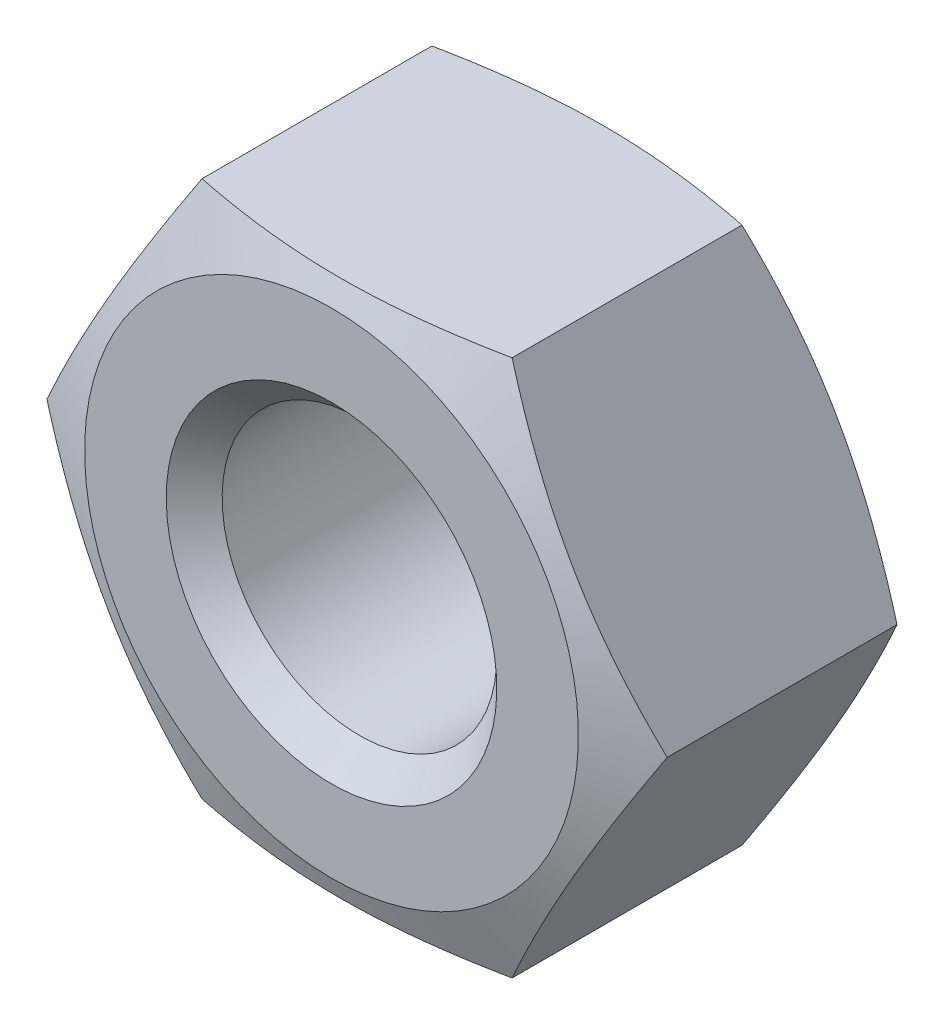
ISO-10303-21;
HEADER;
FILE_DESCRIPTION(('STEP AP214'),'2;1');
FILE_NAME('part.step','',(''),(''),'','','');
FILE_SCHEMA(('AUTOMOTIVE_DESIGN { 1 0 10303 214 1 1 1 1 }'));
ENDSEC;
DATA;
#1=APPLICATION_CONTEXT('core data for automotive mechanical design processes');
#2=APPLICATION_PROTOCOL_DEFINITION('international standard','automotive_design',2000,#1);
#3=PRODUCT_CONTEXT('',#1,'mechanical');
#4=PRODUCT('Part','Part','',(#3));
#5=PRODUCT_RELATED_PRODUCT_CATEGORY('part','',(#4));
#6=PRODUCT_DEFINITION_FORMATION('','',#4);
#7=PRODUCT_DEFINITION_CONTEXT('part definition',#1,'design');
#8=PRODUCT_DEFINITION('design','',#6,#7);
#9=PRODUCT_DEFINITION_SHAPE('','',#8);
#10=(LENGTH_UNIT() NAMED_UNIT(*) SI_UNIT(.MILLI.,.METRE.));
#11=(NAMED_UNIT(*) PLANE_ANGLE_UNIT() SI_UNIT($,.RADIAN.));
#12=(NAMED_UNIT(*) SI_UNIT($,.STERADIAN.) SOLID_ANGLE_UNIT());
#13=UNCERTAINTY_MEASURE_WITH_UNIT(LENGTH_MEASURE(1.E-05),#10,'distance_accuracy_value','');
#14=(GEOMETRIC_REPRESENTATION_CONTEXT(3) GLOBAL_UNCERTAINTY_ASSIGNED_CONTEXT((#13)) GLOBAL_UNIT_ASSIGNED_CONTEXT((#10,
#11,#12)) REPRESENTATION_CONTEXT('',''));
#15=CARTESIAN_POINT('',(0.,0.,0.));
#16=DIRECTION('',(0.,0.,1.));
#17=DIRECTION('',(1.,0.,0.));
#18=AXIS2_PLACEMENT_3D('',#15,#16,#17);
#19=CARTESIAN_POINT('',(7.50555,0.,6.8));
#20=DIRECTION('',(0.,0.,1.));
#21=DIRECTION('',(1.,0.,0.));
#22=AXIS2_PLACEMENT_3D('',#19,#20,#21);
#23=PLANE('',#22);
#24=CARTESIAN_POINT('',(0.,0.,6.8));
#25=DIRECTION('',(0.,0.,-1.));
#26=DIRECTION('',(0.,1.,0.));
#27=AXIS2_PLACEMENT_3D('',#24,#25,#26);
#28=CIRCLE('',#27,4.);
#29=CARTESIAN_POINT('',(0.,4.,6.8));
#30=VERTEX_POINT('',#29);
#31=EDGE_CURVE('E205',#30,#30,#28,.T.);
#32=ORIENTED_EDGE('',*,*,#31,.T.);
#33=EDGE_LOOP('',(#32));
#34=FACE_BOUND('',#33,.T.);
#35=CARTESIAN_POINT('',(0.,0.,6.8));
#36=DIRECTION('',(0.,0.,-1.));
#37=DIRECTION('',(0.,1.,0.));
#38=AXIS2_PLACEMENT_3D('',#35,#36,#37);
#39=CIRCLE('',#38,5.9754963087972);
#40=CARTESIAN_POINT('',(0.,5.9754963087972,6.8));
#41=VERTEX_POINT('',#40);
#42=EDGE_CURVE('E208',#41,#41,#39,.T.);
#43=ORIENTED_EDGE('',*,*,#42,.F.);
#44=EDGE_LOOP('',(#43));
#45=FACE_BOUND('',#44,.T.);
#46=ADVANCED_FACE('F14',(#34,#45),#23,.T.);
#47=CARTESIAN_POINT('',(0.,0.,6.8));
#48=DIRECTION('',(0.,0.,1.));
#49=DIRECTION('',(0.,-1.,0.));
#50=AXIS2_PLACEMENT_3D('',#47,#48,#49);
#51=CONICAL_SURFACE('',#50,4.,0.785398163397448);
#52=CARTESIAN_POINT('',(0.,0.,6.1234375));
#53=DIRECTION('',(0.,0.,-1.));
#54=DIRECTION('',(0.,1.,0.));
#55=AXIS2_PLACEMENT_3D('',#52,#53,#54);
#56=CIRCLE('',#55,3.3234375);
#57=CARTESIAN_POINT('',(0.,3.3234375,6.1234375));
#58=VERTEX_POINT('',#57);
#59=EDGE_CURVE('E95',#58,#58,#56,.T.);
#60=ORIENTED_EDGE('',*,*,#59,.T.);
#61=EDGE_LOOP('',(#60));
#62=FACE_BOUND('',#61,.T.);
#63=ORIENTED_EDGE('',*,*,#31,.F.);
#64=EDGE_LOOP('',(#63));
#65=FACE_BOUND('',#64,.T.);
#66=ADVANCED_FACE('F138',(#62,#65),#51,.F.);
#67=CARTESIAN_POINT('',(0.,0.,0.));
#68=DIRECTION('',(0.,0.,-1.));
#69=DIRECTION('',(0.,1.,0.));
#70=AXIS2_PLACEMENT_3D('',#67,#68,#69);
#71=CYLINDRICAL_SURFACE('',#70,3.3234375);
#72=CARTESIAN_POINT('',(0.,0.,0.6765625));
#73=DIRECTION('',(0.,0.,-1.));
#74=DIRECTION('',(0.,1.,0.));
#75=AXIS2_PLACEMENT_3D('',#72,#73,#74);
#76=CIRCLE('',#75,3.3234375);
#77=CARTESIAN_POINT('',(0.,3.3234375,0.6765625));
#78=VERTEX_POINT('',#77);
#79=EDGE_CURVE('E92',#78,#78,#76,.T.);
#80=ORIENTED_EDGE('',*,*,#79,.T.);
#81=EDGE_LOOP('',(#80));
#82=FACE_BOUND('',#81,.T.);
#83=ORIENTED_EDGE('',*,*,#59,.F.);
#84=EDGE_LOOP('',(#83));
#85=FACE_BOUND('',#84,.T.);
#86=ADVANCED_FACE('F200',(#82,#85),#71,.F.);
#87=CARTESIAN_POINT('',(0.,0.,0.));
#88=DIRECTION('',(0.,0.,-1.));
#89=DIRECTION('',(0.,1.,0.));
#90=AXIS2_PLACEMENT_3D('',#87,#88,#89);
#91=CONICAL_SURFACE('',#90,4.,0.785398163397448);
#92=ORIENTED_EDGE('',*,*,#79,.F.);
#93=EDGE_LOOP('',(#92));
#94=FACE_BOUND('',#93,.T.);
#95=CARTESIAN_POINT('',(0.,0.,0.));
#96=DIRECTION('',(0.,0.,-1.));
#97=DIRECTION('',(0.,1.,0.));
#98=AXIS2_PLACEMENT_3D('',#95,#96,#97);
#99=CIRCLE('',#98,4.);
#100=CARTESIAN_POINT('',(0.,4.,0.));
#101=VERTEX_POINT('',#100);
#102=EDGE_CURVE('E209',#101,#101,#99,.T.);
#103=ORIENTED_EDGE('',*,*,#102,.T.);
#104=EDGE_LOOP('',(#103));
#105=FACE_BOUND('',#104,.T.);
#106=ADVANCED_FACE('F136',(#94,#105),#91,.F.);
#107=CARTESIAN_POINT('',(0.,0.,6.18181818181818));
#108=DIRECTION('',(0.,0.,-1.));
#109=DIRECTION('',(0.,1.,0.));
#110=AXIS2_PLACEMENT_3D('',#107,#108,#109);
#111=CONICAL_SURFACE('',#110,7.50555,1.18682389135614);
#112=ORIENTED_EDGE('',*,*,#42,.T.);
#113=EDGE_LOOP('',(#112));
#114=FACE_BOUND('',#113,.T.);
#115=CARTESIAN_POINT('',(-9.9193088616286,-6.49999696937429,4.42279492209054));
#116=CARTESIAN_POINT('',(-9.62612976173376,-6.49999696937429,4.5218419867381));
#117=CARTESIAN_POINT('',(-9.3325605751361,-6.49999696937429,4.61975569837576));
#118=CARTESIAN_POINT('',(-8.74444019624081,-6.49999696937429,4.81268318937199));
#119=CARTESIAN_POINT('',(-8.44988891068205,-6.49999696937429,4.90769668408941));
#120=CARTESIAN_POINT('',(-7.8589466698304,-6.49999696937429,5.09439618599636));
#121=CARTESIAN_POINT('',(-7.56255298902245,-6.49999696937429,5.18607359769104));
#122=CARTESIAN_POINT('',(-6.96842688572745,-6.49999696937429,5.36497357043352));
#123=CARTESIAN_POINT('',(-6.67069449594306,-6.49999696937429,5.45219623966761));
#124=CARTESIAN_POINT('',(-6.07749078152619,-6.49999696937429,5.61997733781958));
#125=CARTESIAN_POINT('',(-5.78203974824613,-6.49999696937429,5.70060715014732));
#126=CARTESIAN_POINT('',(-5.18934038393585,-6.49999696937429,5.85505393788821));
#127=CARTESIAN_POINT('',(-4.8920920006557,-6.49999696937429,5.92887071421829));
#128=CARTESIAN_POINT('',(-4.29575537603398,-6.49999696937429,6.06792713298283));
#129=CARTESIAN_POINT('',(-3.9966682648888,-6.49999696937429,6.13317158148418));
#130=CARTESIAN_POINT('',(-3.39636834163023,-6.49999696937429,6.25306571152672));
#131=CARTESIAN_POINT('',(-3.09515568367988,-6.49999696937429,6.30771615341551));
#132=CARTESIAN_POINT('',(-2.55247765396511,-6.49999696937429,6.3942718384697));
#133=CARTESIAN_POINT('',(-2.31139156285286,-6.49999696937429,6.42854298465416));
#134=CARTESIAN_POINT('',(-1.82807101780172,-6.49999696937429,6.4877891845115));
#135=CARTESIAN_POINT('',(-1.58583659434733,-6.49999696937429,6.51276448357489));
#136=CARTESIAN_POINT('',(-1.1006741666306,-6.49999696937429,6.55243028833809));
#137=CARTESIAN_POINT('',(-0.857746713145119,-6.49999696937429,6.56712744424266));
#138=CARTESIAN_POINT('',(-0.371473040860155,-6.49999696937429,6.5856209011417));
#139=CARTESIAN_POINT('',(-0.128126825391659,-6.49999696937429,6.58941728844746));
#140=CARTESIAN_POINT('',(0.359662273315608,-6.49999696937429,6.58592570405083));
#141=CARTESIAN_POINT('',(0.604104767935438,-6.49999696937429,6.57858403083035));
#142=CARTESIAN_POINT('',(1.09241838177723,-6.49999696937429,6.55305516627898));
#143=CARTESIAN_POINT('',(1.33628949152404,-6.49999696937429,6.53486779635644));
#144=CARTESIAN_POINT('',(1.82321426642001,-6.49999696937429,6.48841131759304));
#145=CARTESIAN_POINT('',(2.06626731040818,-6.49999696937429,6.46013578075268));
#146=CARTESIAN_POINT('',(2.55113865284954,-6.49999696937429,6.3945695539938));
#147=CARTESIAN_POINT('',(2.79295695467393,-6.4999969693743,6.35727888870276));
#148=CARTESIAN_POINT('',(3.31552776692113,-6.4999969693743,6.26797739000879));
#149=CARTESIAN_POINT('',(3.59603630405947,-6.4999969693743,6.21454818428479));
#150=CARTESIAN_POINT('',(4.15523748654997,-6.49999696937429,6.09884430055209));
#151=CARTESIAN_POINT('',(4.4339299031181,-6.49999696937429,6.03656852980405));
#152=CARTESIAN_POINT('',(4.98973006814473,-6.4999969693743,5.90477408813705));
#153=CARTESIAN_POINT('',(5.26683696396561,-6.49999696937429,5.8352518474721));
#154=CARTESIAN_POINT('',(5.81949820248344,-6.49999696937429,5.69036285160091));
#155=CARTESIAN_POINT('',(6.09505260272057,-6.4999969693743,5.61499631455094));
#156=CARTESIAN_POINT('',(6.64553916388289,-6.4999969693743,5.45932492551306));
#157=CARTESIAN_POINT('',(6.92046778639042,-6.4999969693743,5.37900761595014));
#158=CARTESIAN_POINT('',(7.46916437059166,-6.4999969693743,5.21450845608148));
#159=CARTESIAN_POINT('',(7.74293232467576,-6.4999969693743,5.13032658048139));
#160=CARTESIAN_POINT('',(8.28940004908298,-6.4999969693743,4.95883283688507));
#161=CARTESIAN_POINT('',(8.56210009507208,-6.4999969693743,4.87152184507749));
#162=CARTESIAN_POINT('',(9.10665643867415,-6.4999969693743,4.69430366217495));
#163=CARTESIAN_POINT('',(9.37851272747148,-6.4999969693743,4.60439644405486));
#164=CARTESIAN_POINT('',(10.1893622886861,-6.4999969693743,4.33269358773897));
#165=CARTESIAN_POINT('',(10.7273011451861,-6.4999969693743,4.1477522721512));
#166=CARTESIAN_POINT('',(11.8011433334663,-6.4999969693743,3.77195807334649));
#167=CARTESIAN_POINT('',(12.337046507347,-6.4999969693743,3.5811047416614));
#168=CARTESIAN_POINT('',(13.4037617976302,-6.4999969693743,3.19638995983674));
#169=CARTESIAN_POINT('',(13.934584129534,-6.4999969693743,3.00255679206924));
#170=CARTESIAN_POINT('',(14.7299098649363,-6.4999969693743,2.70945395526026));
#171=CARTESIAN_POINT('',(14.9948504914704,-6.4999969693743,2.6113670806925));
#172=CARTESIAN_POINT('',(15.5244732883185,-6.4999969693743,2.41450084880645));
#173=CARTESIAN_POINT('',(15.7891554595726,-6.4999969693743,2.31572149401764));
#174=CARTESIAN_POINT('',(16.053725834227,-6.4999969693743,2.21664343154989));
#175=B_SPLINE_CURVE_WITH_KNOTS('',3,(#115,#116,#117,#118,#119,#120,#121,#122,#123,#124,#125,
#126,#127,#128,#129,#130,#131,#132,#133,#134,#135,#136,#137,#138,#139,#140,#141,#142,#143,#144,
#145,#146,#147,#148,#149,#150,#151,#152,#153,#154,#155,#156,#157,#158,#159,#160,#161,#162,#163,
#164,#165,#166,#167,#168,#169,#170,#171,#172,#173,#174),.UNSPECIFIED.,.F.,.F.,(4,2,2,2,2,2,2,2,
2,2,2,2,2,2,2,2,2,2,2,2,2,2,2,2,2,2,2,2,2,4),(0.,0.928382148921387,1.85685512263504,
2.78757170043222,3.71826566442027,4.63696855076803,5.55569827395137,6.47391069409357,
7.39205718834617,8.12243097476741,8.85278547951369,9.58266698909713,10.3125427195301,
11.0459487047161,11.7793667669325,12.5132529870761,13.247137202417,14.1036136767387,
14.9601960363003,15.8172023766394,16.6741767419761,17.5334032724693,18.3926354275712,
19.2516288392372,20.1106311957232,21.8171010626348,23.523700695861,25.2190012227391,
26.0665447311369,26.9140851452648),.UNSPECIFIED.);
#176=CARTESIAN_POINT('',(-3.752775,-6.49999696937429,6.18181818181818));
#177=VERTEX_POINT('',#176);
#178=CARTESIAN_POINT('',(3.752775,-6.4999969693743,6.18181818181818));
#179=VERTEX_POINT('',#178);
#180=EDGE_CURVE('E75',#177,#179,#175,.T.);
#181=ORIENTED_EDGE('',*,*,#180,.T.);
#182=CARTESIAN_POINT('',(3.75277488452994,-6.4999971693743,6.18181813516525));
#183=CARTESIAN_POINT('',(3.88388671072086,-6.27290482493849,6.23479379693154));
#184=CARTESIAN_POINT('',(4.0154312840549,-6.04506294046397,6.28377831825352));
#185=CARTESIAN_POINT('',(4.27939025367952,-5.5878725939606,6.37225953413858));
#186=CARTESIAN_POINT('',(4.41180511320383,-5.3585233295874,6.41175066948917));
#187=CARTESIAN_POINT('',(4.67731617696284,-4.89864467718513,6.47966399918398));
#188=CARTESIAN_POINT('',(4.81041216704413,-4.66811566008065,6.50808947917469));
#189=CARTESIAN_POINT('',(5.07709854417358,-4.20620130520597,6.55255421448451));
#190=CARTESIAN_POINT('',(5.21068881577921,-3.9748161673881,6.56859619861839));
#191=CARTESIAN_POINT('',(5.47583563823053,-3.51556839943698,6.58729635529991));
#192=CARTESIAN_POINT('',(5.60738820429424,-3.28771267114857,6.59017716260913));
#193=CARTESIAN_POINT('',(5.87041559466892,-2.83213586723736,6.58300544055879));
#194=CARTESIAN_POINT('',(6.00189041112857,-2.60441480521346,6.57295177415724));
#195=CARTESIAN_POINT('',(6.26436520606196,-2.1497951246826,6.54045156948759));
#196=CARTESIAN_POINT('',(6.39536543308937,-1.92289607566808,6.51801290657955));
#197=CARTESIAN_POINT('',(6.65674042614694,-1.4701813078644,6.46183013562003));
#198=CARTESIAN_POINT('',(6.78711525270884,-1.24436548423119,6.42808714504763));
#199=CARTESIAN_POINT('',(6.96628658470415,-0.934031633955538,6.37474923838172));
#200=CARTESIAN_POINT('',(7.01540954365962,-0.848948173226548,6.35940032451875));
#201=CARTESIAN_POINT('',(7.11353952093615,-0.67898206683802,6.32736591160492));
#202=CARTESIAN_POINT('',(7.16254655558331,-0.594099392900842,6.31068061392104));
#203=CARTESIAN_POINT('',(7.26061650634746,-0.424237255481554,6.27599122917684));
#204=CARTESIAN_POINT('',(7.30967903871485,-0.339258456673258,6.25798281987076));
#205=CARTESIAN_POINT('',(7.40769660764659,-0.169487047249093,6.22077431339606));
#206=CARTESIAN_POINT('',(7.45665163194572,-0.084694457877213,6.20157408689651));
#207=CARTESIAN_POINT('',(7.50555011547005,1.99999999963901E-07,6.18181813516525));
#208=B_SPLINE_CURVE_WITH_KNOTS('',3,(#182,#183,#184,#185,#186,#187,#188,#189,#190,#191,#192,
#193,#194,#195,#196,#197,#198,#199,#200,#201,#202,#203,#204,#205,#206,#207),.UNSPECIFIED.,.F.,
.F.,(4,2,2,2,2,2,2,2,2,2,2,2,4),(0.,0.802620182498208,1.60570923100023,2.40855964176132,
3.21123308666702,4.00027695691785,4.78939019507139,5.57800222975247,6.36653632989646,
6.66484369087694,6.96310618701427,7.26239050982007,7.56170736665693),.UNSPECIFIED.);
#209=CARTESIAN_POINT('',(7.50555,0.,6.18181818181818));
#210=VERTEX_POINT('',#209);
#211=EDGE_CURVE('E160',#179,#210,#208,.T.);
#212=ORIENTED_EDGE('',*,*,#211,.T.);
#213=CARTESIAN_POINT('',(7.50555011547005,-2.0000000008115E-07,6.18181813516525));
#214=CARTESIAN_POINT('',(7.37443828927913,0.227092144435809,6.23479379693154));
#215=CARTESIAN_POINT('',(7.2428937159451,0.454934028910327,6.28377831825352));
#216=CARTESIAN_POINT('',(6.97893474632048,0.9121243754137,6.37225953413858));
#217=CARTESIAN_POINT('',(6.84651988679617,1.14147363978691,6.41175066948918));
#218=CARTESIAN_POINT('',(6.58100882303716,1.60135229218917,6.47966399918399));
#219=CARTESIAN_POINT('',(6.44791283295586,1.83188130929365,6.50808947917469));
#220=CARTESIAN_POINT('',(6.18122645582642,2.29379566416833,6.55255421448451));
#221=CARTESIAN_POINT('',(6.04763618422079,2.5251808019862,6.56859619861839));
#222=CARTESIAN_POINT('',(5.78248936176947,2.98442856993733,6.58729635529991));
#223=CARTESIAN_POINT('',(5.65093679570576,3.21228429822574,6.59017716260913));
#224=CARTESIAN_POINT('',(5.38790940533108,3.66786110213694,6.58300544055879));
#225=CARTESIAN_POINT('',(5.25643458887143,3.89558216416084,6.57295177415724));
#226=CARTESIAN_POINT('',(4.99395979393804,4.3502018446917,6.54045156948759));
#227=CARTESIAN_POINT('',(4.86295956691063,4.57710089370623,6.51801290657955));
#228=CARTESIAN_POINT('',(4.60158457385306,5.0298156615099,6.46183013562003));
#229=CARTESIAN_POINT('',(4.47120974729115,5.25563148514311,6.42808714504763));
#230=CARTESIAN_POINT('',(4.29203841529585,5.56596533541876,6.37474923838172));
#231=CARTESIAN_POINT('',(4.24291545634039,5.65104879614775,6.35940032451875));
#232=CARTESIAN_POINT('',(4.14478547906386,5.82101490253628,6.32736591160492));
#233=CARTESIAN_POINT('',(4.09577844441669,5.90589757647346,6.31068061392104));
#234=CARTESIAN_POINT('',(3.99770849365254,6.07575971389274,6.27599122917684));
#235=CARTESIAN_POINT('',(3.94864596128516,6.16073851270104,6.25798281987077));
#236=CARTESIAN_POINT('',(3.85062839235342,6.3305099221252,6.22077431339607));
#237=CARTESIAN_POINT('',(3.80167336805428,6.41530251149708,6.20157408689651));
#238=CARTESIAN_POINT('',(3.75277488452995,6.49999716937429,6.18181813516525));
#239=B_SPLINE_CURVE_WITH_KNOTS('',3,(#213,#214,#215,#216,#217,#218,#219,#220,#221,#222,#223,
#224,#225,#226,#227,#228,#229,#230,#231,#232,#233,#234,#235,#236,#237,#238),.UNSPECIFIED.,.F.,
.F.,(4,2,2,2,2,2,2,2,2,2,2,2,4),(0.,0.802620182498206,1.60570923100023,2.40855964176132,
3.21123308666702,4.00027695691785,4.78939019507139,5.57800222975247,6.36653632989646,
6.66484369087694,6.96310618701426,7.26239050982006,7.56170736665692),.UNSPECIFIED.);
#240=CARTESIAN_POINT('',(3.752775,6.49999696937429,6.18181818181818));
#241=VERTEX_POINT('',#240);
#242=EDGE_CURVE('E37',#210,#241,#239,.T.);
#243=ORIENTED_EDGE('',*,*,#242,.T.);
#244=CARTESIAN_POINT('',(-9.91930886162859,6.4999969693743,4.42279492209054));
#245=CARTESIAN_POINT('',(-9.62612976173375,6.49999696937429,4.5218419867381));
#246=CARTESIAN_POINT('',(-9.3325605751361,6.49999696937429,4.61975569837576));
#247=CARTESIAN_POINT('',(-8.7444401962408,6.49999696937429,4.81268318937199));
#248=CARTESIAN_POINT('',(-8.44988891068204,6.49999696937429,4.90769668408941));
#249=CARTESIAN_POINT('',(-7.85894666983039,6.49999696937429,5.09439618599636));
#250=CARTESIAN_POINT('',(-7.56255298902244,6.49999696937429,5.18607359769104));
#251=CARTESIAN_POINT('',(-6.96842688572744,6.49999696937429,5.36497357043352));
#252=CARTESIAN_POINT('',(-6.67069449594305,6.49999696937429,5.4521962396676));
#253=CARTESIAN_POINT('',(-6.07749078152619,6.49999696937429,5.61997733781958));
#254=CARTESIAN_POINT('',(-5.78203974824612,6.49999696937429,5.70060715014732));
#255=CARTESIAN_POINT('',(-5.18934038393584,6.49999696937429,5.85505393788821));
#256=CARTESIAN_POINT('',(-4.89209200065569,6.49999696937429,5.92887071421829));
#257=CARTESIAN_POINT('',(-4.29575537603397,6.49999696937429,6.06792713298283));
#258=CARTESIAN_POINT('',(-3.99666826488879,6.49999696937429,6.13317158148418));
#259=CARTESIAN_POINT('',(-3.39636834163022,6.49999696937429,6.25306571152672));
#260=CARTESIAN_POINT('',(-3.09515568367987,6.4999969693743,6.30771615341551));
#261=CARTESIAN_POINT('',(-2.55247765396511,6.4999969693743,6.3942718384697));
#262=CARTESIAN_POINT('',(-2.31139156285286,6.49999696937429,6.42854298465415));
#263=CARTESIAN_POINT('',(-1.82807101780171,6.49999696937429,6.4877891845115));
#264=CARTESIAN_POINT('',(-1.58583659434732,6.49999696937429,6.51276448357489));
#265=CARTESIAN_POINT('',(-1.1006741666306,6.49999696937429,6.55243028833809));
#266=CARTESIAN_POINT('',(-0.857746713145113,6.49999696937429,6.56712744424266));
#267=CARTESIAN_POINT('',(-0.371473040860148,6.49999696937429,6.5856209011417));
#268=CARTESIAN_POINT('',(-0.128126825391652,6.49999696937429,6.58941728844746));
#269=CARTESIAN_POINT('',(0.359662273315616,6.49999696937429,6.58592570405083));
#270=CARTESIAN_POINT('',(0.604104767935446,6.49999696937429,6.57858403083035));
#271=CARTESIAN_POINT('',(1.09241838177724,6.49999696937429,6.55305516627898));
#272=CARTESIAN_POINT('',(1.33628949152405,6.49999696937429,6.53486779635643));
#273=CARTESIAN_POINT('',(1.82321426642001,6.49999696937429,6.48841131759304));
#274=CARTESIAN_POINT('',(2.06626731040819,6.49999696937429,6.46013578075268));
#275=CARTESIAN_POINT('',(2.55113865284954,6.49999696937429,6.3945695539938));
#276=CARTESIAN_POINT('',(2.79295695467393,6.49999696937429,6.35727888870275));
#277=CARTESIAN_POINT('',(3.31552776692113,6.49999696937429,6.26797739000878));
#278=CARTESIAN_POINT('',(3.59603630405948,6.49999696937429,6.21454818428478));
#279=CARTESIAN_POINT('',(4.15523748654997,6.49999696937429,6.09884430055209));
#280=CARTESIAN_POINT('',(4.4339299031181,6.49999696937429,6.03656852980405));
#281=CARTESIAN_POINT('',(4.98973006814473,6.49999696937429,5.90477408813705));
#282=CARTESIAN_POINT('',(5.26683696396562,6.49999696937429,5.8352518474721));
#283=CARTESIAN_POINT('',(5.81949820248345,6.49999696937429,5.69036285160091));
#284=CARTESIAN_POINT('',(6.09505260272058,6.49999696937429,5.61499631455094));
#285=CARTESIAN_POINT('',(6.6455391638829,6.49999696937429,5.45932492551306));
#286=CARTESIAN_POINT('',(6.92046778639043,6.49999696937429,5.37900761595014));
#287=CARTESIAN_POINT('',(7.46916437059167,6.49999696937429,5.21450845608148));
#288=CARTESIAN_POINT('',(7.74293232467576,6.49999696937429,5.13032658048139));
#289=CARTESIAN_POINT('',(8.28940004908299,6.49999696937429,4.95883283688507));
#290=CARTESIAN_POINT('',(8.56210009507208,6.49999696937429,4.87152184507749));
#291=CARTESIAN_POINT('',(9.10665643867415,6.49999696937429,4.69430366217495));
#292=CARTESIAN_POINT('',(9.37851272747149,6.49999696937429,4.60439644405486));
#293=CARTESIAN_POINT('',(10.1893622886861,6.49999696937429,4.33269358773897));
#294=CARTESIAN_POINT('',(10.7273011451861,6.49999696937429,4.1477522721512));
#295=CARTESIAN_POINT('',(11.8011433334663,6.49999696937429,3.77195807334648));
#296=CARTESIAN_POINT('',(12.337046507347,6.49999696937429,3.5811047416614));
#297=CARTESIAN_POINT('',(13.4037617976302,6.49999696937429,3.19638995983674));
#298=CARTESIAN_POINT('',(13.934584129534,6.49999696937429,3.00255679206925));
#299=CARTESIAN_POINT('',(14.7299098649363,6.49999696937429,2.70945395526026));
#300=CARTESIAN_POINT('',(14.9948504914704,6.49999696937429,2.6113670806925));
#301=CARTESIAN_POINT('',(15.5244732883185,6.49999696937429,2.41450084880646));
#302=CARTESIAN_POINT('',(15.7891554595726,6.49999696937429,2.31572149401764));
#303=CARTESIAN_POINT('',(16.053725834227,6.49999696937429,2.21664343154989));
#304=B_SPLINE_CURVE_WITH_KNOTS('',3,(#244,#245,#246,#247,#248,#249,#250,#251,#252,#253,#254,
#255,#256,#257,#258,#259,#260,#261,#262,#263,#264,#265,#266,#267,#268,#269,#270,#271,#272,#273,
#274,#275,#276,#277,#278,#279,#280,#281,#282,#283,#284,#285,#286,#287,#288,#289,#290,#291,#292,
#293,#294,#295,#296,#297,#298,#299,#300,#301,#302,#303),.UNSPECIFIED.,.F.,.F.,(4,2,2,2,2,2,2,2,
2,2,2,2,2,2,2,2,2,2,2,2,2,2,2,2,2,2,2,2,2,4),(0.,0.928382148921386,1.85685512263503,
2.78757170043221,3.71826566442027,4.63696855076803,5.55569827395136,6.47391069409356,
7.39205718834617,8.1224309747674,8.85278547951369,9.58266698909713,10.3125427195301,
11.0459487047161,11.7793667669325,12.513252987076,13.247137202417,14.1036136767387,
14.9601960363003,15.8172023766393,16.6741767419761,17.5334032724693,18.3926354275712,
19.2516288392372,20.1106311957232,21.8171010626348,23.523700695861,25.219001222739,
26.0665447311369,26.9140851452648),.UNSPECIFIED.);
#305=CARTESIAN_POINT('',(-3.752775,6.4999969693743,6.18181818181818));
#306=VERTEX_POINT('',#305);
#307=EDGE_CURVE('E151',#241,#306,#304,.F.);
#308=ORIENTED_EDGE('',*,*,#307,.T.);
#309=CARTESIAN_POINT('',(-3.75277488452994,6.4999971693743,6.18181813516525));
#310=CARTESIAN_POINT('',(-3.88388671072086,6.27290482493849,6.23479379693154));
#311=CARTESIAN_POINT('',(-4.0154312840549,6.04506294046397,6.28377831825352));
#312=CARTESIAN_POINT('',(-4.27939025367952,5.5878725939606,6.37225953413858));
#313=CARTESIAN_POINT('',(-4.41180511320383,5.35852332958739,6.41175066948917));
#314=CARTESIAN_POINT('',(-4.67731617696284,4.89864467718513,6.47966399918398));
#315=CARTESIAN_POINT('',(-4.81041216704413,4.66811566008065,6.50808947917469));
#316=CARTESIAN_POINT('',(-5.07709854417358,4.20620130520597,6.55255421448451));
#317=CARTESIAN_POINT('',(-5.21068881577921,3.9748161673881,6.56859619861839));
#318=CARTESIAN_POINT('',(-5.47583563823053,3.51556839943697,6.58729635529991));
#319=CARTESIAN_POINT('',(-5.60738820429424,3.28771267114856,6.59017716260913));
#320=CARTESIAN_POINT('',(-5.87041559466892,2.83213586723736,6.58300544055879));
#321=CARTESIAN_POINT('',(-6.00189041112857,2.60441480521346,6.57295177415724));
#322=CARTESIAN_POINT('',(-6.26436520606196,2.1497951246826,6.54045156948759));
#323=CARTESIAN_POINT('',(-6.39536543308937,1.92289607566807,6.51801290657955));
#324=CARTESIAN_POINT('',(-6.65674042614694,1.47018130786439,6.46183013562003));
#325=CARTESIAN_POINT('',(-6.78711525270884,1.24436548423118,6.42808714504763));
#326=CARTESIAN_POINT('',(-6.96628658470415,0.934031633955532,6.37474923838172));
#327=CARTESIAN_POINT('',(-7.01540954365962,0.848948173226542,6.35940032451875));
#328=CARTESIAN_POINT('',(-7.11353952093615,0.678982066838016,6.32736591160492));
#329=CARTESIAN_POINT('',(-7.16254655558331,0.594099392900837,6.31068061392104));
#330=CARTESIAN_POINT('',(-7.26061650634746,0.424237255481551,6.27599122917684));
#331=CARTESIAN_POINT('',(-7.30967903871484,0.339258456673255,6.25798281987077));
#332=CARTESIAN_POINT('',(-7.40769660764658,0.169487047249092,6.22077431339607));
#333=CARTESIAN_POINT('',(-7.45665163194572,0.0846944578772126,6.20157408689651));
#334=CARTESIAN_POINT('',(-7.50555011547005,-1.99999999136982E-07,6.18181813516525));
#335=B_SPLINE_CURVE_WITH_KNOTS('',3,(#309,#310,#311,#312,#313,#314,#315,#316,#317,#318,#319,
#320,#321,#322,#323,#324,#325,#326,#327,#328,#329,#330,#331,#332,#333,#334),.UNSPECIFIED.,.F.,
.F.,(4,2,2,2,2,2,2,2,2,2,2,2,4),(0.,0.802620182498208,1.60570923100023,2.40855964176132,
3.21123308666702,4.00027695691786,4.78939019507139,5.57800222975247,6.36653632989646,
6.66484369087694,6.96310618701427,7.26239050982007,7.56170736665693),.UNSPECIFIED.);
#336=CARTESIAN_POINT('',(-7.50555,0.,6.18181818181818));
#337=VERTEX_POINT('',#336);
#338=EDGE_CURVE('E146',#306,#337,#335,.T.);
#339=ORIENTED_EDGE('',*,*,#338,.T.);
#340=CARTESIAN_POINT('',(-7.50555011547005,2.00000000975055E-07,6.18181813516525));
#341=CARTESIAN_POINT('',(-7.37443828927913,-0.227092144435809,6.23479379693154));
#342=CARTESIAN_POINT('',(-7.2428937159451,-0.454934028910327,6.28377831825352));
#343=CARTESIAN_POINT('',(-6.97893474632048,-0.9121243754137,6.37225953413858));
#344=CARTESIAN_POINT('',(-6.84651988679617,-1.14147363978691,6.41175066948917));
#345=CARTESIAN_POINT('',(-6.58100882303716,-1.60135229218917,6.47966399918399));
#346=CARTESIAN_POINT('',(-6.44791283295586,-1.83188130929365,6.50808947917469));
#347=CARTESIAN_POINT('',(-6.18122645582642,-2.29379566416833,6.55255421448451));
#348=CARTESIAN_POINT('',(-6.04763618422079,-2.5251808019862,6.56859619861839));
#349=CARTESIAN_POINT('',(-5.78248936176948,-2.98442856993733,6.58729635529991));
#350=CARTESIAN_POINT('',(-5.65093679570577,-3.21228429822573,6.59017716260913));
#351=CARTESIAN_POINT('',(-5.38790940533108,-3.66786110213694,6.58300544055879));
#352=CARTESIAN_POINT('',(-5.25643458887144,-3.89558216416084,6.57295177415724));
#353=CARTESIAN_POINT('',(-4.99395979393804,-4.35020184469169,6.54045156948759));
#354=CARTESIAN_POINT('',(-4.86295956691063,-4.57710089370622,6.51801290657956));
#355=CARTESIAN_POINT('',(-4.60158457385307,-5.0298156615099,6.46183013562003));
#356=CARTESIAN_POINT('',(-4.47120974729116,-5.25563148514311,6.42808714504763));
#357=CARTESIAN_POINT('',(-4.29203841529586,-5.56596533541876,6.37474923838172));
#358=CARTESIAN_POINT('',(-4.24291545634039,-5.65104879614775,6.35940032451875));
#359=CARTESIAN_POINT('',(-4.14478547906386,-5.82101490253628,6.32736591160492));
#360=CARTESIAN_POINT('',(-4.09577844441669,-5.90589757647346,6.31068061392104));
#361=CARTESIAN_POINT('',(-3.99770849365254,-6.07575971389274,6.27599122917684));
#362=CARTESIAN_POINT('',(-3.94864596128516,-6.16073851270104,6.25798281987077));
#363=CARTESIAN_POINT('',(-3.85062839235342,-6.3305099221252,6.22077431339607));
#364=CARTESIAN_POINT('',(-3.80167336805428,-6.41530251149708,6.20157408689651));
#365=CARTESIAN_POINT('',(-3.75277488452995,-6.49999716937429,6.18181813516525));
#366=B_SPLINE_CURVE_WITH_KNOTS('',3,(#340,#341,#342,#343,#344,#345,#346,#347,#348,#349,#350,
#351,#352,#353,#354,#355,#356,#357,#358,#359,#360,#361,#362,#363,#364,#365),.UNSPECIFIED.,.F.,
.F.,(4,2,2,2,2,2,2,2,2,2,2,2,4),(0.,0.802620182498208,1.60570923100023,2.40855964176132,
3.21123308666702,4.00027695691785,4.78939019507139,5.57800222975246,6.36653632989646,
6.66484369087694,6.96310618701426,7.26239050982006,7.56170736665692),.UNSPECIFIED.);
#367=EDGE_CURVE('E123',#337,#177,#366,.T.);
#368=ORIENTED_EDGE('',*,*,#367,.T.);
#369=EDGE_LOOP('',(#181,#212,#243,#308,#339,#368));
#370=FACE_BOUND('',#369,.T.);
#371=ADVANCED_FACE('F132',(#114,#370),#111,.T.);
#372=CARTESIAN_POINT('',(3.752775,-6.4999969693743,6.8));
#373=DIRECTION('',(-0.866025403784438,0.5,0.));
#374=DIRECTION('',(-0.5,-0.866025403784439,0.));
#375=AXIS2_PLACEMENT_3D('',#372,#373,#374);
#376=PLANE('',#375);
#377=ORIENTED_EDGE('',*,*,#211,.F.);
#378=DIRECTION('',(0.,0.,-1.));
#379=VECTOR('',#378,1.);
#380=CARTESIAN_POINT('',(3.752775,-6.4999969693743,6.8));
#381=LINE('',#380,#379);
#382=CARTESIAN_POINT('',(3.752775,-6.4999969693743,0.618181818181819));
#383=VERTEX_POINT('',#382);
#384=EDGE_CURVE('E79',#179,#383,#381,.T.);
#385=ORIENTED_EDGE('',*,*,#384,.T.);
#386=CARTESIAN_POINT('',(7.50555011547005,2.E-07,0.618181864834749));
#387=CARTESIAN_POINT('',(7.37443828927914,-0.227092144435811,0.565206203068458));
#388=CARTESIAN_POINT('',(7.2428937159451,-0.45493402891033,0.516221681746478));
#389=CARTESIAN_POINT('',(6.97893474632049,-0.912124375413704,0.427740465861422));
#390=CARTESIAN_POINT('',(6.84651988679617,-1.14147363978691,0.388249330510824));
#391=CARTESIAN_POINT('',(6.58100882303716,-1.60135229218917,0.320336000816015));
#392=CARTESIAN_POINT('',(6.44791283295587,-1.83188130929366,0.291910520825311));
#393=CARTESIAN_POINT('',(6.18122645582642,-2.29379566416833,0.247445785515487));
#394=CARTESIAN_POINT('',(6.04763618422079,-2.52518080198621,0.231403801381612));
#395=CARTESIAN_POINT('',(5.78248936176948,-2.98442856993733,0.212703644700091));
#396=CARTESIAN_POINT('',(5.65093679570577,-3.21228429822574,0.209822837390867));
#397=CARTESIAN_POINT('',(5.38790940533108,-3.66786110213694,0.216994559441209));
#398=CARTESIAN_POINT('',(5.25643458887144,-3.89558216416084,0.22704822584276));
#399=CARTESIAN_POINT('',(4.99395979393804,-4.3502018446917,0.259548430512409));
#400=CARTESIAN_POINT('',(4.86295956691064,-4.57710089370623,0.281987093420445));
#401=CARTESIAN_POINT('',(4.60158457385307,-5.0298156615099,0.338169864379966));
#402=CARTESIAN_POINT('',(4.47120974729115,-5.25563148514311,0.371912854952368));
#403=CARTESIAN_POINT('',(4.29203841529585,-5.56596533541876,0.425250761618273));
#404=CARTESIAN_POINT('',(4.24291545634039,-5.65104879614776,0.440599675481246));
#405=CARTESIAN_POINT('',(4.14478547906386,-5.82101490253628,0.472634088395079));
#406=CARTESIAN_POINT('',(4.09577844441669,-5.90589757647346,0.489319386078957));
#407=CARTESIAN_POINT('',(3.99770849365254,-6.07575971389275,0.524008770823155));
#408=CARTESIAN_POINT('',(3.94864596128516,-6.16073851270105,0.542017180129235));
#409=CARTESIAN_POINT('',(3.85062839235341,-6.33050992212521,0.579225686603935));
#410=CARTESIAN_POINT('',(3.80167336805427,-6.41530251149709,0.598425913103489));
#411=CARTESIAN_POINT('',(3.75277488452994,-6.4999971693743,0.61818186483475));
#412=B_SPLINE_CURVE_WITH_KNOTS('',3,(#386,#387,#388,#389,#390,#391,#392,#393,#394,#395,#396,
#397,#398,#399,#400,#401,#402,#403,#404,#405,#406,#407,#408,#409,#410,#411),.UNSPECIFIED.,.F.,
.F.,(4,2,2,2,2,2,2,2,2,2,2,2,4),(0.,0.802620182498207,1.60570923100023,2.40855964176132,
3.21123308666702,4.00027695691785,4.78939019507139,5.57800222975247,6.36653632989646,
6.66484369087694,6.96310618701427,7.26239050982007,7.56170736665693),.UNSPECIFIED.);
#413=CARTESIAN_POINT('',(7.50555,0.,0.618181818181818));
#414=VERTEX_POINT('',#413);
#415=EDGE_CURVE('E30',#414,#383,#412,.T.);
#416=ORIENTED_EDGE('',*,*,#415,.F.);
#417=DIRECTION('',(0.,0.,-1.));
#418=VECTOR('',#417,1.);
#419=CARTESIAN_POINT('',(7.50555,0.,6.8));
#420=LINE('',#419,#418);
#421=EDGE_CURVE('E23',#210,#414,#420,.T.);
#422=ORIENTED_EDGE('',*,*,#421,.F.);
#423=EDGE_LOOP('',(#377,#385,#416,#422));
#424=FACE_BOUND('',#423,.T.);
#425=ADVANCED_FACE('F16',(#424),#376,.F.);
#426=CARTESIAN_POINT('',(7.50555,0.,6.8));
#427=DIRECTION('',(-0.866025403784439,-0.5,0.));
#428=DIRECTION('',(0.5,-0.866025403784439,0.));
#429=AXIS2_PLACEMENT_3D('',#426,#427,#428);
#430=PLANE('',#429);
#431=ORIENTED_EDGE('',*,*,#242,.F.);
#432=ORIENTED_EDGE('',*,*,#421,.T.);
#433=CARTESIAN_POINT('',(3.75277488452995,6.49999716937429,0.618181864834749));
#434=CARTESIAN_POINT('',(3.88388671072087,6.27290482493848,0.565206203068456));
#435=CARTESIAN_POINT('',(4.0154312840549,6.04506294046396,0.516221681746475));
#436=CARTESIAN_POINT('',(4.27939025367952,5.58787259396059,0.427740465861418));
#437=CARTESIAN_POINT('',(4.41180511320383,5.35852332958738,0.388249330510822));
#438=CARTESIAN_POINT('',(4.67731617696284,4.89864467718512,0.320336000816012));
#439=CARTESIAN_POINT('',(4.81041216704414,4.66811566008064,0.291910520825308));
#440=CARTESIAN_POINT('',(5.07709854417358,4.20620130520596,0.247445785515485));
#441=CARTESIAN_POINT('',(5.21068881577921,3.97481616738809,0.23140380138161));
#442=CARTESIAN_POINT('',(5.47583563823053,3.51556839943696,0.212703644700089));
#443=CARTESIAN_POINT('',(5.60738820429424,3.28771267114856,0.209822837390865));
#444=CARTESIAN_POINT('',(5.87041559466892,2.83213586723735,0.216994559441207));
#445=CARTESIAN_POINT('',(6.00189041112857,2.60441480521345,0.227048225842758));
#446=CARTESIAN_POINT('',(6.26436520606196,2.1497951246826,0.259548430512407));
#447=CARTESIAN_POINT('',(6.39536543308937,1.92289607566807,0.281987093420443));
#448=CARTESIAN_POINT('',(6.65674042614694,1.47018130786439,0.338169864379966));
#449=CARTESIAN_POINT('',(6.78711525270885,1.24436548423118,0.37191285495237));
#450=CARTESIAN_POINT('',(6.96628658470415,0.934031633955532,0.425250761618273));
#451=CARTESIAN_POINT('',(7.01540954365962,0.848948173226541,0.440599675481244));
#452=CARTESIAN_POINT('',(7.11353952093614,0.678982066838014,0.472634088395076));
#453=CARTESIAN_POINT('',(7.16254655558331,0.594099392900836,0.489319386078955));
#454=CARTESIAN_POINT('',(7.26061650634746,0.424237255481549,0.524008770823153));
#455=CARTESIAN_POINT('',(7.30967903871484,0.339258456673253,0.542017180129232));
#456=CARTESIAN_POINT('',(7.40769660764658,0.16948704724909,0.579225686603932));
#457=CARTESIAN_POINT('',(7.45665163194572,0.0846944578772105,0.598425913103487));
#458=CARTESIAN_POINT('',(7.50555011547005,-2.00000000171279E-07,0.618181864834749));
#459=B_SPLINE_CURVE_WITH_KNOTS('',3,(#433,#434,#435,#436,#437,#438,#439,#440,#441,#442,#443,
#444,#445,#446,#447,#448,#449,#450,#451,#452,#453,#454,#455,#456,#457,#458),.UNSPECIFIED.,.F.,
.F.,(4,2,2,2,2,2,2,2,2,2,2,2,4),(0.,0.802620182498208,1.60570923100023,2.40855964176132,
3.21123308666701,4.00027695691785,4.78939019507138,5.57800222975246,6.36653632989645,
6.66484369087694,6.96310618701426,7.26239050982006,7.56170736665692),.UNSPECIFIED.);
#460=CARTESIAN_POINT('',(3.752775,6.49999696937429,0.618181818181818));
#461=VERTEX_POINT('',#460);
#462=EDGE_CURVE('E171',#461,#414,#459,.T.);
#463=ORIENTED_EDGE('',*,*,#462,.F.);
#464=DIRECTION('',(0.,0.,-1.));
#465=VECTOR('',#464,1.);
#466=CARTESIAN_POINT('',(3.752775,6.49999696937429,6.8));
#467=LINE('',#466,#465);
#468=EDGE_CURVE('E385',#241,#461,#467,.T.);
#469=ORIENTED_EDGE('',*,*,#468,.F.);
#470=EDGE_LOOP('',(#431,#432,#463,#469));
#471=FACE_BOUND('',#470,.T.);
#472=ADVANCED_FACE('F165',(#471),#430,.F.);
#473=CARTESIAN_POINT('',(3.752775,6.49999696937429,6.8));
#474=DIRECTION('',(0.,-1.,0.));
#475=DIRECTION('',(1.,0.,0.));
#476=AXIS2_PLACEMENT_3D('',#473,#474,#475);
#477=PLANE('',#476);
#478=ORIENTED_EDGE('',*,*,#307,.F.);
#479=ORIENTED_EDGE('',*,*,#468,.T.);
#480=CARTESIAN_POINT('',(-9.91930886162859,6.4999969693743,2.37720507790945));
#481=CARTESIAN_POINT('',(-9.62612976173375,6.49999696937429,2.27815801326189));
#482=CARTESIAN_POINT('',(-9.33256057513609,6.49999696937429,2.18024430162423));
#483=CARTESIAN_POINT('',(-8.7444401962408,6.49999696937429,1.98731681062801));
#484=CARTESIAN_POINT('',(-8.44988891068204,6.49999696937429,1.89230331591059));
#485=CARTESIAN_POINT('',(-7.85894666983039,6.49999696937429,1.70560381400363));
#486=CARTESIAN_POINT('',(-7.56255298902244,6.49999696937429,1.61392640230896));
#487=CARTESIAN_POINT('',(-6.96842688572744,6.49999696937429,1.43502642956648));
#488=CARTESIAN_POINT('',(-6.67069449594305,6.49999696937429,1.34780376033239));
#489=CARTESIAN_POINT('',(-6.07749078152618,6.49999696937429,1.18002266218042));
#490=CARTESIAN_POINT('',(-5.78203974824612,6.49999696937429,1.09939284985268));
#491=CARTESIAN_POINT('',(-5.18934038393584,6.49999696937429,0.944946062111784));
#492=CARTESIAN_POINT('',(-4.89209200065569,6.49999696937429,0.871129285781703));
#493=CARTESIAN_POINT('',(-4.29575537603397,6.49999696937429,0.73207286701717));
#494=CARTESIAN_POINT('',(-3.99666826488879,6.49999696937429,0.666828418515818));
#495=CARTESIAN_POINT('',(-3.39636834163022,6.49999696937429,0.546934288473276));
#496=CARTESIAN_POINT('',(-3.09515568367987,6.4999969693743,0.492283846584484));
#497=CARTESIAN_POINT('',(-2.55247765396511,6.4999969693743,0.405728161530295));
#498=CARTESIAN_POINT('',(-2.31139156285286,6.49999696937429,0.371457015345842));
#499=CARTESIAN_POINT('',(-1.82807101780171,6.49999696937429,0.312210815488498));
#500=CARTESIAN_POINT('',(-1.58583659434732,6.49999696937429,0.287235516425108));
#501=CARTESIAN_POINT('',(-1.1006741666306,6.49999696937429,0.247569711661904));
#502=CARTESIAN_POINT('',(-0.857746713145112,6.49999696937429,0.232872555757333));
#503=CARTESIAN_POINT('',(-0.371473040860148,6.49999696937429,0.214379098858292));
#504=CARTESIAN_POINT('',(-0.128126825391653,6.49999696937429,0.21058271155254));
#505=CARTESIAN_POINT('',(0.359662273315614,6.49999696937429,0.214074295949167));
#506=CARTESIAN_POINT('',(0.604104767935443,6.49999696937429,0.22141596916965));
#507=CARTESIAN_POINT('',(1.09241838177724,6.49999696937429,0.246944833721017));
#508=CARTESIAN_POINT('',(1.33628949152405,6.49999696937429,0.265132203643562));
#509=CARTESIAN_POINT('',(1.82321426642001,6.49999696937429,0.311588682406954));
#510=CARTESIAN_POINT('',(2.06626731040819,6.49999696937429,0.339864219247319));
#511=CARTESIAN_POINT('',(2.55113865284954,6.49999696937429,0.405430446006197));
#512=CARTESIAN_POINT('',(2.79295695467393,6.49999696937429,0.442721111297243));
#513=CARTESIAN_POINT('',(3.31552776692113,6.49999696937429,0.532022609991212));
#514=CARTESIAN_POINT('',(3.59603630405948,6.49999696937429,0.585451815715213));
#515=CARTESIAN_POINT('',(4.15523748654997,6.49999696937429,0.70115569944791));
#516=CARTESIAN_POINT('',(4.4339299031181,6.49999696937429,0.763431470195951));
#517=CARTESIAN_POINT('',(4.98973006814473,6.49999696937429,0.895225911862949));
#518=CARTESIAN_POINT('',(5.26683696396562,6.49999696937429,0.9647481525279));
#519=CARTESIAN_POINT('',(5.81949820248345,6.49999696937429,1.10963714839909));
#520=CARTESIAN_POINT('',(6.09505260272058,6.49999696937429,1.18500368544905));
#521=CARTESIAN_POINT('',(6.6455391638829,6.49999696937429,1.34067507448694));
#522=CARTESIAN_POINT('',(6.92046778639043,6.49999696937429,1.42099238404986));
#523=CARTESIAN_POINT('',(7.46916437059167,6.49999696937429,1.58549154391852));
#524=CARTESIAN_POINT('',(7.74293232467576,6.49999696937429,1.66967341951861));
#525=CARTESIAN_POINT('',(8.28940004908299,6.49999696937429,1.84116716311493));
#526=CARTESIAN_POINT('',(8.56210009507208,6.49999696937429,1.9284781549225));
#527=CARTESIAN_POINT('',(9.10665643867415,6.49999696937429,2.10569633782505));
#528=CARTESIAN_POINT('',(9.37851272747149,6.49999696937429,2.19560355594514));
#529=CARTESIAN_POINT('',(10.1893622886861,6.49999696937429,2.46730641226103));
#530=CARTESIAN_POINT('',(10.7273011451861,6.49999696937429,2.6522477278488));
#531=CARTESIAN_POINT('',(11.8011433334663,6.49999696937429,3.02804192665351));
#532=CARTESIAN_POINT('',(12.337046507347,6.49999696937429,3.2188952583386));
#533=CARTESIAN_POINT('',(13.4037617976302,6.49999696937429,3.60361004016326));
#534=CARTESIAN_POINT('',(13.934584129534,6.49999696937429,3.79744320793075));
#535=CARTESIAN_POINT('',(14.7299098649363,6.49999696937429,4.09054604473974));
#536=CARTESIAN_POINT('',(14.9948504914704,6.49999696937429,4.1886329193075));
#537=CARTESIAN_POINT('',(15.5244732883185,6.49999696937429,4.38549915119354));
#538=CARTESIAN_POINT('',(15.7891554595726,6.49999696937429,4.48427850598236));
#539=CARTESIAN_POINT('',(16.053725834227,6.49999696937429,4.58335656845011));
#540=B_SPLINE_CURVE_WITH_KNOTS('',3,(#480,#481,#482,#483,#484,#485,#486,#487,#488,#489,#490,
#491,#492,#493,#494,#495,#496,#497,#498,#499,#500,#501,#502,#503,#504,#505,#506,#507,#508,#509,
#510,#511,#512,#513,#514,#515,#516,#517,#518,#519,#520,#521,#522,#523,#524,#525,#526,#527,#528,
#529,#530,#531,#532,#533,#534,#535,#536,#537,#538,#539),.UNSPECIFIED.,.F.,.F.,(4,2,2,2,2,2,2,2,
2,2,2,2,2,2,2,2,2,2,2,2,2,2,2,2,2,2,2,2,2,4),(0.,0.928382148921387,1.85685512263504,
2.78757170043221,3.71826566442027,4.63696855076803,5.55569827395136,6.47391069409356,
7.39205718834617,8.1224309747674,8.85278547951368,9.58266698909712,10.3125427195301,
11.045948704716,11.7793667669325,12.513252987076,13.2471372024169,14.1036136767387,
14.9601960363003,15.8172023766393,16.6741767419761,17.5334032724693,18.3926354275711,
19.2516288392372,20.1106311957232,21.8171010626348,23.523700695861,25.219001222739,
26.0665447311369,26.9140851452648),.UNSPECIFIED.);
#541=CARTESIAN_POINT('',(-3.752775,6.4999969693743,0.618181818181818));
#542=VERTEX_POINT('',#541);
#543=EDGE_CURVE('E176',#542,#461,#540,.T.);
#544=ORIENTED_EDGE('',*,*,#543,.F.);
#545=DIRECTION('',(0.,0.,-1.));
#546=VECTOR('',#545,1.);
#547=CARTESIAN_POINT('',(-3.752775,6.4999969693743,6.8));
#548=LINE('',#547,#546);
#549=EDGE_CURVE('E387',#306,#542,#548,.T.);
#550=ORIENTED_EDGE('',*,*,#549,.F.);
#551=EDGE_LOOP('',(#478,#479,#544,#550));
#552=FACE_BOUND('',#551,.T.);
#553=ADVANCED_FACE('F168',(#552),#477,.F.);
#554=CARTESIAN_POINT('',(-3.752775,6.4999969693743,6.8));
#555=DIRECTION('',(0.866025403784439,-0.5,0.));
#556=DIRECTION('',(0.5,0.866025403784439,0.));
#557=AXIS2_PLACEMENT_3D('',#554,#555,#556);
#558=PLANE('',#557);
#559=ORIENTED_EDGE('',*,*,#338,.F.);
#560=ORIENTED_EDGE('',*,*,#549,.T.);
#561=CARTESIAN_POINT('',(-7.50555011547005,-1.99999999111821E-07,0.618181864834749));
#562=CARTESIAN_POINT('',(-7.37443828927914,0.22709214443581,0.565206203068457));
#563=CARTESIAN_POINT('',(-7.2428937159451,0.454934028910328,0.516221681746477));
#564=CARTESIAN_POINT('',(-6.97893474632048,0.912124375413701,0.42774046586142));
#565=CARTESIAN_POINT('',(-6.84651988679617,1.14147363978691,0.388249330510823));
#566=CARTESIAN_POINT('',(-6.58100882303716,1.60135229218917,0.320336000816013));
#567=CARTESIAN_POINT('',(-6.44791283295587,1.83188130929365,0.291910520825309));
#568=CARTESIAN_POINT('',(-6.18122645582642,2.29379566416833,0.247445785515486));
#569=CARTESIAN_POINT('',(-6.04763618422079,2.52518080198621,0.231403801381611));
#570=CARTESIAN_POINT('',(-5.78248936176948,2.98442856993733,0.21270364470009));
#571=CARTESIAN_POINT('',(-5.65093679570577,3.21228429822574,0.209822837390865));
#572=CARTESIAN_POINT('',(-5.38790940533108,3.66786110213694,0.216994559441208));
#573=CARTESIAN_POINT('',(-5.25643458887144,3.89558216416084,0.227048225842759));
#574=CARTESIAN_POINT('',(-4.99395979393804,4.3502018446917,0.259548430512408));
#575=CARTESIAN_POINT('',(-4.86295956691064,4.57710089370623,0.281987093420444));
#576=CARTESIAN_POINT('',(-4.60158457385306,5.0298156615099,0.338169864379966));
#577=CARTESIAN_POINT('',(-4.47120974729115,5.25563148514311,0.371912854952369));
#578=CARTESIAN_POINT('',(-4.29203841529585,5.56596533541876,0.425250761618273));
#579=CARTESIAN_POINT('',(-4.24291545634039,5.65104879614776,0.440599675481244));
#580=CARTESIAN_POINT('',(-4.14478547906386,5.82101490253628,0.472634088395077));
#581=CARTESIAN_POINT('',(-4.09577844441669,5.90589757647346,0.489319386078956));
#582=CARTESIAN_POINT('',(-3.99770849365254,6.07575971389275,0.524008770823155));
#583=CARTESIAN_POINT('',(-3.94864596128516,6.16073851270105,0.542017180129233));
#584=CARTESIAN_POINT('',(-3.85062839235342,6.33050992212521,0.579225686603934));
#585=CARTESIAN_POINT('',(-3.80167336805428,6.41530251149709,0.598425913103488));
#586=CARTESIAN_POINT('',(-3.75277488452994,6.4999971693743,0.618181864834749));
#587=B_SPLINE_CURVE_WITH_KNOTS('',3,(#561,#562,#563,#564,#565,#566,#567,#568,#569,#570,#571,
#572,#573,#574,#575,#576,#577,#578,#579,#580,#581,#582,#583,#584,#585,#586),.UNSPECIFIED.,.F.,
.F.,(4,2,2,2,2,2,2,2,2,2,2,2,4),(0.,0.802620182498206,1.60570923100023,2.40855964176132,
3.21123308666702,4.00027695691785,4.78939019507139,5.57800222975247,6.36653632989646,
6.66484369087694,6.96310618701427,7.26239050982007,7.56170736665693),.UNSPECIFIED.);
#588=CARTESIAN_POINT('',(-7.50555,0.,0.618181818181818));
#589=VERTEX_POINT('',#588);
#590=EDGE_CURVE('E88',#589,#542,#587,.T.);
#591=ORIENTED_EDGE('',*,*,#590,.F.);
#592=DIRECTION('',(0.,0.,-1.));
#593=VECTOR('',#592,1.);
#594=CARTESIAN_POINT('',(-7.50555,0.,6.8));
#595=LINE('',#594,#593);
#596=EDGE_CURVE('E78',#337,#589,#595,.T.);
#597=ORIENTED_EDGE('',*,*,#596,.F.);
#598=EDGE_LOOP('',(#559,#560,#591,#597));
#599=FACE_BOUND('',#598,.T.);
#600=ADVANCED_FACE('F184',(#599),#558,.F.);
#601=CARTESIAN_POINT('',(-7.50555,0.,6.8));
#602=DIRECTION('',(0.866025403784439,0.5,0.));
#603=DIRECTION('',(-0.5,0.866025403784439,0.));
#604=AXIS2_PLACEMENT_3D('',#601,#602,#603);
#605=PLANE('',#604);
#606=ORIENTED_EDGE('',*,*,#367,.F.);
#607=ORIENTED_EDGE('',*,*,#596,.T.);
#608=CARTESIAN_POINT('',(-3.75277488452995,-6.49999716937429,0.61818186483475));
#609=CARTESIAN_POINT('',(-3.88388671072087,-6.27290482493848,0.565206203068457));
#610=CARTESIAN_POINT('',(-4.0154312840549,-6.04506294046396,0.516221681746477));
#611=CARTESIAN_POINT('',(-4.27939025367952,-5.58787259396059,0.427740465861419));
#612=CARTESIAN_POINT('',(-4.41180511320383,-5.35852332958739,0.388249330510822));
#613=CARTESIAN_POINT('',(-4.67731617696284,-4.89864467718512,0.320336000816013));
#614=CARTESIAN_POINT('',(-4.81041216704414,-4.66811566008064,0.291910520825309));
#615=CARTESIAN_POINT('',(-5.07709854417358,-4.20620130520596,0.247445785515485));
#616=CARTESIAN_POINT('',(-5.21068881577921,-3.97481616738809,0.23140380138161));
#617=CARTESIAN_POINT('',(-5.47583563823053,-3.51556839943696,0.212703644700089));
#618=CARTESIAN_POINT('',(-5.60738820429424,-3.28771267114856,0.209822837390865));
#619=CARTESIAN_POINT('',(-5.87041559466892,-2.83213586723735,0.216994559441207));
#620=CARTESIAN_POINT('',(-6.00189041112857,-2.60441480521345,0.227048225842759));
#621=CARTESIAN_POINT('',(-6.26436520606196,-2.1497951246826,0.259548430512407));
#622=CARTESIAN_POINT('',(-6.39536543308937,-1.92289607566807,0.281987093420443));
#623=CARTESIAN_POINT('',(-6.65674042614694,-1.47018130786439,0.338169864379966));
#624=CARTESIAN_POINT('',(-6.78711525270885,-1.24436548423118,0.37191285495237));
#625=CARTESIAN_POINT('',(-6.96628658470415,-0.934031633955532,0.425250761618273));
#626=CARTESIAN_POINT('',(-7.01540954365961,-0.848948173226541,0.440599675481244));
#627=CARTESIAN_POINT('',(-7.11353952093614,-0.678982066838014,0.472634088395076));
#628=CARTESIAN_POINT('',(-7.16254655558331,-0.594099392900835,0.489319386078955));
#629=CARTESIAN_POINT('',(-7.26061650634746,-0.424237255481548,0.524008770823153));
#630=CARTESIAN_POINT('',(-7.30967903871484,-0.339258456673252,0.542017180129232));
#631=CARTESIAN_POINT('',(-7.40769660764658,-0.169487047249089,0.579225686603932));
#632=CARTESIAN_POINT('',(-7.45665163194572,-0.0846944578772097,0.598425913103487));
#633=CARTESIAN_POINT('',(-7.50555011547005,2.0000000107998E-07,0.618181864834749));
#634=B_SPLINE_CURVE_WITH_KNOTS('',3,(#608,#609,#610,#611,#612,#613,#614,#615,#616,#617,#618,
#619,#620,#621,#622,#623,#624,#625,#626,#627,#628,#629,#630,#631,#632,#633),.UNSPECIFIED.,.F.,
.F.,(4,2,2,2,2,2,2,2,2,2,2,2,4),(0.,0.802620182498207,1.60570923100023,2.40855964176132,
3.21123308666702,4.00027695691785,4.78939019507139,5.57800222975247,6.36653632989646,
6.66484369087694,6.96310618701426,7.26239050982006,7.56170736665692),.UNSPECIFIED.);
#635=CARTESIAN_POINT('',(-3.752775,-6.49999696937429,0.618181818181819));
#636=VERTEX_POINT('',#635);
#637=EDGE_CURVE('E83',#636,#589,#634,.T.);
#638=ORIENTED_EDGE('',*,*,#637,.F.);
#639=DIRECTION('',(0.,0.,-1.));
#640=VECTOR('',#639,1.);
#641=CARTESIAN_POINT('',(-3.752775,-6.49999696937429,6.8));
#642=LINE('',#641,#640);
#643=EDGE_CURVE('E69',#177,#636,#642,.T.);
#644=ORIENTED_EDGE('',*,*,#643,.F.);
#645=EDGE_LOOP('',(#606,#607,#638,#644));
#646=FACE_BOUND('',#645,.T.);
#647=ADVANCED_FACE('F84',(#646),#605,.F.);
#648=CARTESIAN_POINT('',(-3.752775,-6.49999696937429,6.8));
#649=DIRECTION('',(0.,1.,0.));
#650=DIRECTION('',(-1.,0.,0.));
#651=AXIS2_PLACEMENT_3D('',#648,#649,#650);
#652=PLANE('',#651);
#653=ORIENTED_EDGE('',*,*,#180,.F.);
#654=ORIENTED_EDGE('',*,*,#643,.T.);
#655=CARTESIAN_POINT('',(-9.9193088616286,-6.49999696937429,2.37720507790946));
#656=CARTESIAN_POINT('',(-9.62612976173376,-6.49999696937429,2.2781580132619));
#657=CARTESIAN_POINT('',(-9.3325605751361,-6.49999696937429,2.18024430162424));
#658=CARTESIAN_POINT('',(-8.7444401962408,-6.49999696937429,1.98731681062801));
#659=CARTESIAN_POINT('',(-8.44988891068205,-6.49999696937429,1.89230331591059));
#660=CARTESIAN_POINT('',(-7.8589466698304,-6.49999696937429,1.70560381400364));
#661=CARTESIAN_POINT('',(-7.56255298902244,-6.49999696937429,1.61392640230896));
#662=CARTESIAN_POINT('',(-6.96842688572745,-6.49999696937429,1.43502642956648));
#663=CARTESIAN_POINT('',(-6.67069449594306,-6.49999696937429,1.34780376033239));
#664=CARTESIAN_POINT('',(-6.07749078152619,-6.49999696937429,1.18002266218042));
#665=CARTESIAN_POINT('',(-5.78203974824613,-6.49999696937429,1.09939284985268));
#666=CARTESIAN_POINT('',(-5.18934038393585,-6.49999696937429,0.944946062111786));
#667=CARTESIAN_POINT('',(-4.8920920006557,-6.49999696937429,0.871129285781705));
#668=CARTESIAN_POINT('',(-4.29575537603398,-6.49999696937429,0.732072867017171));
#669=CARTESIAN_POINT('',(-3.9966682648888,-6.49999696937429,0.666828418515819));
#670=CARTESIAN_POINT('',(-3.39636834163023,-6.49999696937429,0.546934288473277));
#671=CARTESIAN_POINT('',(-3.09515568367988,-6.49999696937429,0.492283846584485));
#672=CARTESIAN_POINT('',(-2.55247765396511,-6.49999696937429,0.405728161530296));
#673=CARTESIAN_POINT('',(-2.31139156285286,-6.49999696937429,0.371457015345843));
#674=CARTESIAN_POINT('',(-1.82807101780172,-6.49999696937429,0.3122108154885));
#675=CARTESIAN_POINT('',(-1.58583659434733,-6.49999696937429,0.287235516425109));
#676=CARTESIAN_POINT('',(-1.1006741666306,-6.49999696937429,0.247569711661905));
#677=CARTESIAN_POINT('',(-0.857746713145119,-6.49999696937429,0.232872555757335));
#678=CARTESIAN_POINT('',(-0.371473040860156,-6.49999696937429,0.214379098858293));
#679=CARTESIAN_POINT('',(-0.128126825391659,-6.49999696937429,0.210582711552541));
#680=CARTESIAN_POINT('',(0.359662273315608,-6.49999696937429,0.214074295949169));
#681=CARTESIAN_POINT('',(0.604104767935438,-6.49999696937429,0.221415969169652));
#682=CARTESIAN_POINT('',(1.09241838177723,-6.49999696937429,0.246944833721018));
#683=CARTESIAN_POINT('',(1.33628949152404,-6.49999696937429,0.265132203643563));
#684=CARTESIAN_POINT('',(1.82321426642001,-6.49999696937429,0.311588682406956));
#685=CARTESIAN_POINT('',(2.06626731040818,-6.49999696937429,0.339864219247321));
#686=CARTESIAN_POINT('',(2.55113865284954,-6.49999696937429,0.405430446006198));
#687=CARTESIAN_POINT('',(2.79295695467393,-6.4999969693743,0.442721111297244));
#688=CARTESIAN_POINT('',(3.31552776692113,-6.4999969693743,0.532022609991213));
#689=CARTESIAN_POINT('',(3.59603630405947,-6.4999969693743,0.585451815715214));
#690=CARTESIAN_POINT('',(4.15523748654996,-6.49999696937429,0.70115569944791));
#691=CARTESIAN_POINT('',(4.43392990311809,-6.49999696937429,0.763431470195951));
#692=CARTESIAN_POINT('',(4.98973006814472,-6.4999969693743,0.895225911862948));
#693=CARTESIAN_POINT('',(5.2668369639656,-6.49999696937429,0.964748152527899));
#694=CARTESIAN_POINT('',(5.81949820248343,-6.49999696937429,1.10963714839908));
#695=CARTESIAN_POINT('',(6.09505260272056,-6.4999969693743,1.18500368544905));
#696=CARTESIAN_POINT('',(6.64553916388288,-6.4999969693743,1.34067507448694));
#697=CARTESIAN_POINT('',(6.92046778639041,-6.4999969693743,1.42099238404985));
#698=CARTESIAN_POINT('',(7.46916437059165,-6.4999969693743,1.58549154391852));
#699=CARTESIAN_POINT('',(7.74293232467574,-6.4999969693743,1.66967341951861));
#700=CARTESIAN_POINT('',(8.28940004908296,-6.4999969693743,1.84116716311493));
#701=CARTESIAN_POINT('',(8.56210009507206,-6.4999969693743,1.9284781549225));
#702=CARTESIAN_POINT('',(9.10665643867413,-6.4999969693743,2.10569633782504));
#703=CARTESIAN_POINT('',(9.37851272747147,-6.4999969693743,2.19560355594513));
#704=CARTESIAN_POINT('',(10.1893622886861,-6.4999969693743,2.46730641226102));
#705=CARTESIAN_POINT('',(10.7273011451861,-6.4999969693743,2.65224772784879));
#706=CARTESIAN_POINT('',(11.8011433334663,-6.4999969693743,3.0280419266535));
#707=CARTESIAN_POINT('',(12.3370465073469,-6.4999969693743,3.21889525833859));
#708=CARTESIAN_POINT('',(13.4037617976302,-6.4999969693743,3.60361004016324));
#709=CARTESIAN_POINT('',(13.934584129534,-6.4999969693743,3.79744320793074));
#710=CARTESIAN_POINT('',(14.7299098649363,-6.4999969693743,4.09054604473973));
#711=CARTESIAN_POINT('',(14.9948504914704,-6.4999969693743,4.18863291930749));
#712=CARTESIAN_POINT('',(15.5244732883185,-6.4999969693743,4.38549915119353));
#713=CARTESIAN_POINT('',(15.7891554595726,-6.4999969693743,4.48427850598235));
#714=CARTESIAN_POINT('',(16.0537258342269,-6.4999969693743,4.58335656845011));
#715=B_SPLINE_CURVE_WITH_KNOTS('',3,(#655,#656,#657,#658,#659,#660,#661,#662,#663,#664,#665,
#666,#667,#668,#669,#670,#671,#672,#673,#674,#675,#676,#677,#678,#679,#680,#681,#682,#683,#684,
#685,#686,#687,#688,#689,#690,#691,#692,#693,#694,#695,#696,#697,#698,#699,#700,#701,#702,#703,
#704,#705,#706,#707,#708,#709,#710,#711,#712,#713,#714),.UNSPECIFIED.,.F.,.F.,(4,2,2,2,2,2,2,2,
2,2,2,2,2,2,2,2,2,2,2,2,2,2,2,2,2,2,2,2,2,4),(0.,0.928382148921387,1.85685512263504,
2.78757170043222,3.71826566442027,4.63696855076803,5.55569827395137,6.47391069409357,
7.39205718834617,8.12243097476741,8.85278547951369,9.58266698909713,10.3125427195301,
11.0459487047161,11.7793667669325,12.5132529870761,13.247137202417,14.1036136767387,
14.9601960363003,15.8172023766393,16.6741767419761,17.5334032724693,18.3926354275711,
19.2516288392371,20.1106311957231,21.8171010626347,23.523700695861,25.219001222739,
26.0665447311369,26.9140851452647),.UNSPECIFIED.);
#716=EDGE_CURVE('E73',#383,#636,#715,.F.);
#717=ORIENTED_EDGE('',*,*,#716,.F.);
#718=ORIENTED_EDGE('',*,*,#384,.F.);
#719=EDGE_LOOP('',(#653,#654,#717,#718));
#720=FACE_BOUND('',#719,.T.);
#721=ADVANCED_FACE('F71',(#720),#652,.F.);
#722=CARTESIAN_POINT('',(0.,0.,0.));
#723=DIRECTION('',(0.,0.,1.));
#724=DIRECTION('',(0.,-1.,0.));
#725=AXIS2_PLACEMENT_3D('',#722,#723,#724);
#726=CONICAL_SURFACE('',#725,5.9754963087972,1.18682389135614);
#727=CARTESIAN_POINT('',(0.,0.,0.));
#728=DIRECTION('',(0.,0.,1.));
#729=DIRECTION('',(1.,0.,0.));
#730=AXIS2_PLACEMENT_3D('',#727,#728,#729);
#731=CIRCLE('',#730,5.9754963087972);
#732=CARTESIAN_POINT('',(5.9754963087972,0.,0.));
#733=VERTEX_POINT('',#732);
#734=EDGE_CURVE('E9',#733,#733,#731,.T.);
#735=ORIENTED_EDGE('',*,*,#734,.T.);
#736=EDGE_LOOP('',(#735));
#737=FACE_BOUND('',#736,.T.);
#738=ORIENTED_EDGE('',*,*,#462,.T.);
#739=ORIENTED_EDGE('',*,*,#415,.T.);
#740=ORIENTED_EDGE('',*,*,#716,.T.);
#741=ORIENTED_EDGE('',*,*,#637,.T.);
#742=ORIENTED_EDGE('',*,*,#590,.T.);
#743=ORIENTED_EDGE('',*,*,#543,.T.);
#744=EDGE_LOOP('',(#738,#739,#740,#741,#742,#743));
#745=FACE_BOUND('',#744,.T.);
#746=ADVANCED_FACE('F91',(#737,#745),#726,.T.);
#747=CARTESIAN_POINT('',(7.50555,0.,0.));
#748=DIRECTION('',(0.,0.,1.));
#749=DIRECTION('',(1.,0.,0.));
#750=AXIS2_PLACEMENT_3D('',#747,#748,#749);
#751=PLANE('',#750);
#752=ORIENTED_EDGE('',*,*,#734,.F.);
#753=EDGE_LOOP('',(#752));
#754=FACE_BOUND('',#753,.T.);
#755=ORIENTED_EDGE('',*,*,#102,.F.);
#756=EDGE_LOOP('',(#755));
#757=FACE_BOUND('',#756,.T.);
#758=ADVANCED_FACE('F225',(#754,#757),#751,.F.);
#759=CLOSED_SHELL('',(#46,#66,#86,#106,#371,#425,#472,#553,#600,#647,#721,#746,#758));
#760=MANIFOLD_SOLID_BREP('B1',#759);
#761=ADVANCED_BREP_SHAPE_REPRESENTATION('',(#18,#760),#14);
#762=SHAPE_DEFINITION_REPRESENTATION(#9,#761);
ENDSEC;
END-ISO-10303-21;
